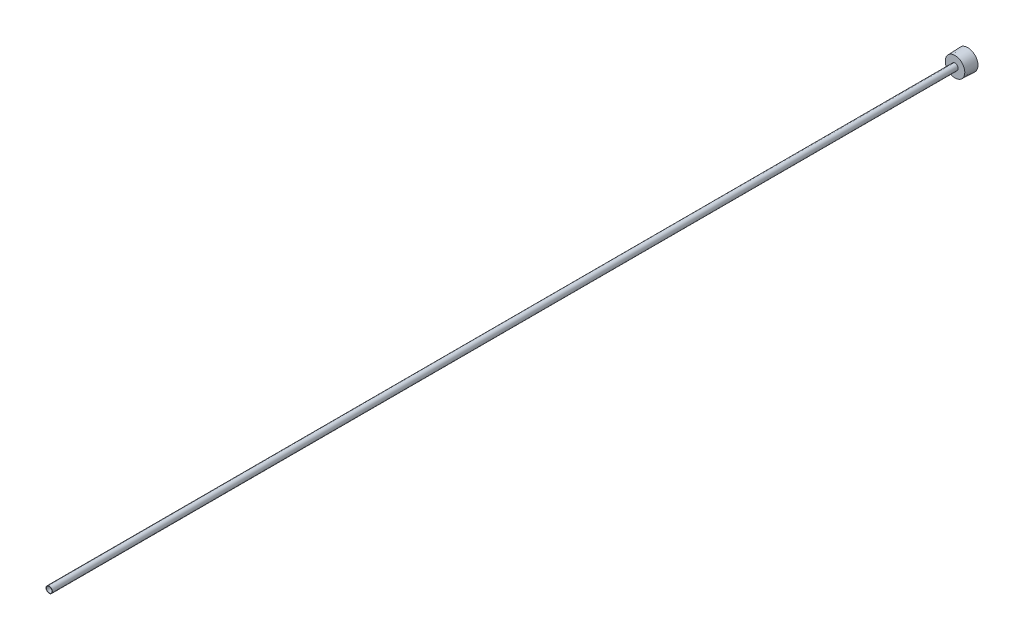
from build123d import *

# Parameters (mm, degrees)
SKETCH2_R          = 1.3843
CUT_EXTRUDE1_DEPTH = 458.256723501
CUT_EXTRUDE2_DEPTH = 4.7625


with BuildPart() as part:
    # Sketch1 → Revolve1 (revolve)
    with BuildSketch(Plane(origin=(0, 0, 0), x_dir=(0, 0, -1), z_dir=(1, 0, 0)), mode=Mode.PRIVATE) as revolve1_sk:
        Polygon((0, 0), (0, 5.0927), (-6.35, 4.861076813), (-6.35, 1.5875), (-457.2, 1.5875), (-457.2, 0), align=None)
    revolve(revolve1_sk.sketch.rotate(Axis((0, 0, 0), (0, 0, -1)), 180), axis=Axis((0, 0, 0), (0, 0, -1)))

    # Sketch2 → Cut-Extrude1 (cut, through all)
    with BuildSketch(Plane.XY.offset(457.2)):
        Circle(SKETCH2_R)
    extrude(amount=-CUT_EXTRUDE1_DEPTH, mode=Mode.SUBTRACT)

    # Sketch3 → Cut-Extrude2 (cut)
    with BuildSketch(Plane(origin=(0, 0, 0), x_dir=(-1, 0, 0), z_dir=(0, 0, -1))):
        Polygon((0, -3.666174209), (3.175, -1.833087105), (3.175, 1.833087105), (0, 3.666174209), (-3.175, 1.833087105), (-3.175, -1.833087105), align=None)
    extrude(amount=-CUT_EXTRUDE2_DEPTH, mode=Mode.SUBTRACT)


solid = part.part
